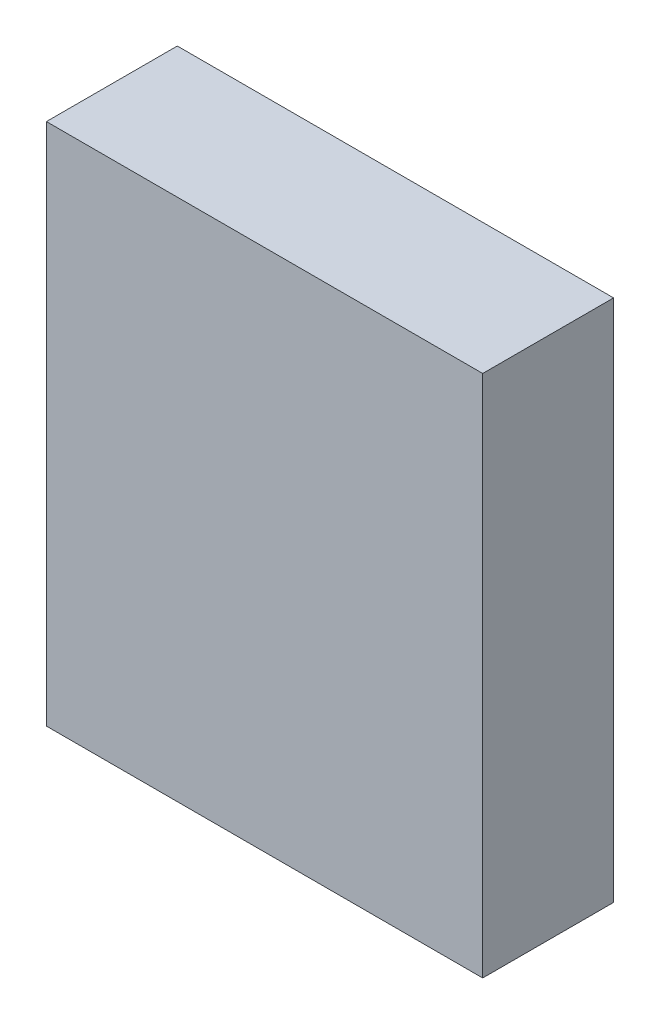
from build123d import *

# Parameters (mm, degrees)
SKETCH1_W      = 50
SKETCH1_H      = 15
EXTRUDE1_DEPTH = 60


with BuildPart() as part:
    # Sketch1 → Extrude1 (new body)
    with BuildSketch(Plane(origin=(0, 0, 0), x_dir=(1, 0, 0), z_dir=(0, 1, 0))):
        with Locations((0, 2.5)):
            Rectangle(SKETCH1_W, SKETCH1_H)
    extrude(amount=EXTRUDE1_DEPTH)


solid = part.part
